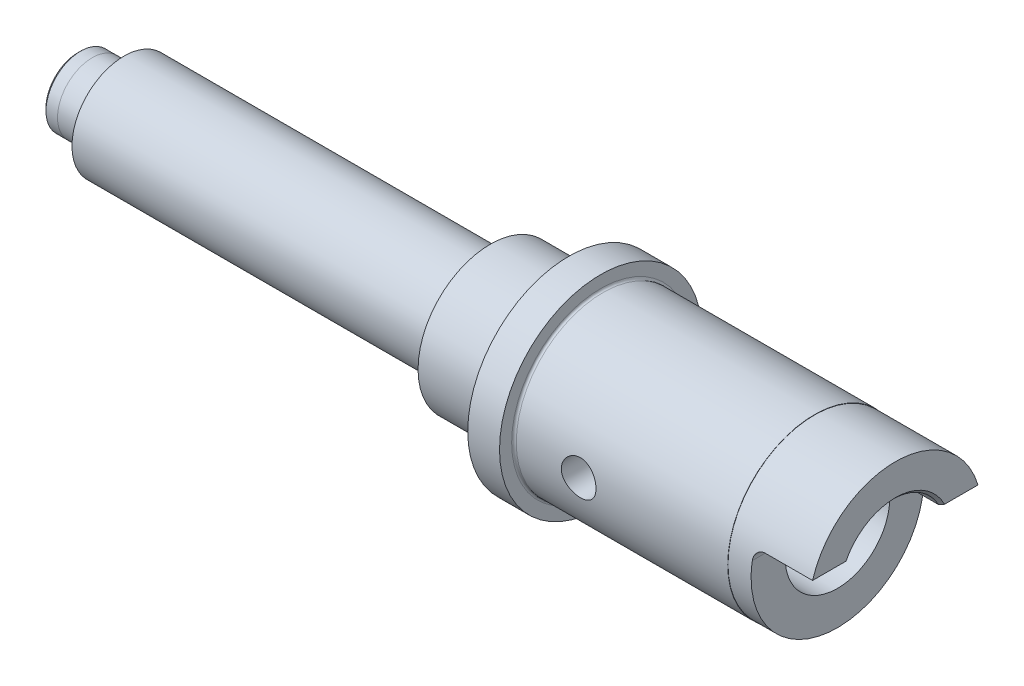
from build123d import *

# Parameters (mm, degrees)
DIAM_TRE_DU_PER_AGE_18_0_18_1_D     = 18.1
DIAM_TRE_DU_PER_AGE_18_0_18_1_DEPTH = 42
DIAM_TRE_DU_PER_AGE_18_0_18_1_TIP   = 5.437788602
ENL_V_MAT_EXTRU_1_DEPTH             = 144.648007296
ENL_V_MAT_EXTRU_1_DEPTH_BACK        = 144.648007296
ESQUISSE4_W                         = 15
ESQUISSE4_H                         = 30
ENL_V_MAT_EXTRU_2_DEPTH             = 144.648007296
ENL_V_MAT_EXTRU_2_DEPTH_BACK        = 144.648007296
ESQUISSE5_R                         = 3
CONG_1_R                            = 0.8
CONG_2_R                            = 0.8
CONG_3_R                            = 0.2
CONG_4_R                            = 0.4
CONG_5_R                            = 1.8
CONG_6_R                            = 1.8
CHANFREIN2_SIZE                     = 0.5


with BuildPart() as part:
    # Esquisse1 → R_volution1 (revolve)
    with BuildSketch(Plane.XY, mode=Mode.PRIVATE) as r_volution1_sk:
        Polygon((0, 0), (0, 5.495), (0.5, 5.995), (2.5, 6), (8, 6), (8, 9), (71.4, 9), (71.4, 12.5), (85, 12.5), (85, 17.5), (90.5, 17.5), (90.5, 15), (127.5, 15), (127.5, 14.95), (141.5, 14.95), (141.5, 0), align=None)
    revolve(r_volution1_sk.sketch.rotate(Axis((-32.853195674, 0, 0), (1, 0, 0)), 90), axis=Axis((-32.853195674, 0, 0), (1, 0, 0)))

    # Diam_tre du per_age _18.0 _18_1
    with Locations(Plane(origin=(141.5, 0, 0), x_dir=(0, 0, -1), z_dir=(1, 0, 0))):
        with Locations((0, 0)):
            Hole(DIAM_TRE_DU_PER_AGE_18_0_18_1_D / 2, depth=DIAM_TRE_DU_PER_AGE_18_0_18_1_DEPTH)
            with Locations((0, 0, -(DIAM_TRE_DU_PER_AGE_18_0_18_1_DEPTH + DIAM_TRE_DU_PER_AGE_18_0_18_1_TIP / 2))):  # 118° drill point
                Cone(0, DIAM_TRE_DU_PER_AGE_18_0_18_1_D / 2, DIAM_TRE_DU_PER_AGE_18_0_18_1_TIP, mode=Mode.SUBTRACT)

    # Esquisse4 → Enl_v. mat.-Extru.1 (cut, two sides: drawn at the far end of the back side and taken through both)
    with BuildSketch(Plane.XY.offset(-ENL_V_MAT_EXTRU_1_DEPTH_BACK)):
        with Locations((139, -10.7)):
            Rectangle(ESQUISSE4_W, ESQUISSE4_H)
    extrude(amount=ENL_V_MAT_EXTRU_1_DEPTH + ENL_V_MAT_EXTRU_1_DEPTH_BACK, mode=Mode.SUBTRACT)

    # Esquisse5 → Enl_v. mat.-Extru.2 (cut, two sides: drawn at the far end of the back side and taken through both)
    with BuildSketch(Plane.XY.offset(-ENL_V_MAT_EXTRU_2_DEPTH_BACK)):
        with Locations((101.7, 0)):
            Circle(ESQUISSE5_R)
    extrude(amount=ENL_V_MAT_EXTRU_2_DEPTH + ENL_V_MAT_EXTRU_2_DEPTH_BACK, mode=Mode.SUBTRACT)

    # Cong_1
    cong_1_edges = [part.edges().sort_by_distance(p)[0] for p in [
        (8, 0, -6),
    ]]
    fillet(cong_1_edges, radius=CONG_1_R)

    # Cong_2
    cong_2_edges = [part.edges().sort_by_distance(p)[0] for p in [
        (71.4, 0, -9),
    ]]
    fillet(cong_2_edges, radius=CONG_2_R)

    # Cong_3
    cong_3_edges = [part.edges().sort_by_distance(p)[0] for p in [
        (85, 0, -12.5),
    ]]
    fillet(cong_3_edges, radius=CONG_3_R)

    # Cong_4
    cong_4_edges = [part.edges().sort_by_distance(p)[0] for p in [
        (90.5, 0, -15),
    ]]
    fillet(cong_4_edges, radius=CONG_4_R)

    # Cong_5
    cong_5_edges = [part.edges().sort_by_distance(p)[0] for p in [
        (131.5, 4.3, 11.140727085),
    ]]
    fillet(cong_5_edges, radius=CONG_5_R)

    # Cong_6
    cong_6_edges = [part.edges().sort_by_distance(p)[0] for p in [
        (131.5, 4.3, -11.140727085),
    ]]
    fillet(cong_6_edges, radius=CONG_6_R)

    # Chanfrein2
    chanfrein2_edges = [part.edges().sort_by_distance(p)[0] for p in [
        (141.5, 9.05, 0),
    ]]
    chamfer(chanfrein2_edges, length=CHANFREIN2_SIZE)


solid = part.part
